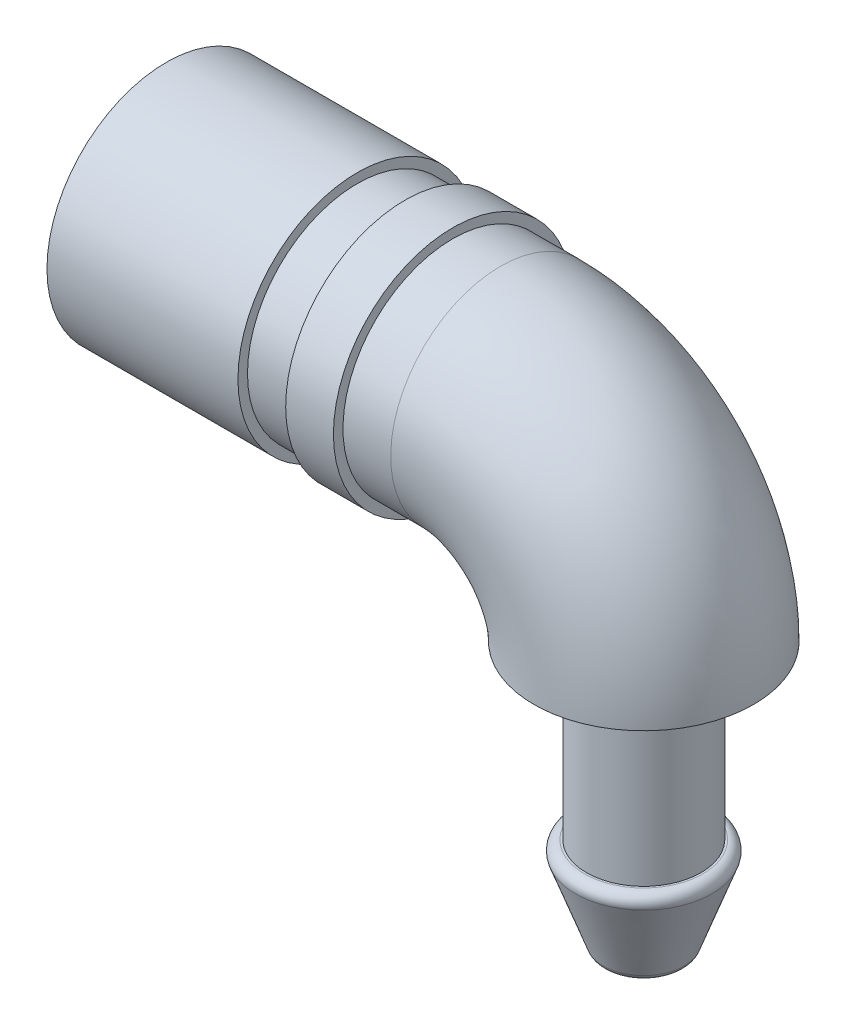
ISO-10303-21;
HEADER;
FILE_DESCRIPTION(('STEP AP214'),'2;1');
FILE_NAME('part.step','',(''),(''),'','','');
FILE_SCHEMA(('AUTOMOTIVE_DESIGN { 1 0 10303 214 1 1 1 1 }'));
ENDSEC;
DATA;
#1=APPLICATION_CONTEXT('core data for automotive mechanical design processes');
#2=APPLICATION_PROTOCOL_DEFINITION('international standard','automotive_design',2000,#1);
#3=PRODUCT_CONTEXT('',#1,'mechanical');
#4=PRODUCT('Part','Part','',(#3));
#5=PRODUCT_RELATED_PRODUCT_CATEGORY('part','',(#4));
#6=PRODUCT_DEFINITION_FORMATION('','',#4);
#7=PRODUCT_DEFINITION_CONTEXT('part definition',#1,'design');
#8=PRODUCT_DEFINITION('design','',#6,#7);
#9=PRODUCT_DEFINITION_SHAPE('','',#8);
#10=(LENGTH_UNIT() NAMED_UNIT(*) SI_UNIT(.MILLI.,.METRE.));
#11=(NAMED_UNIT(*) PLANE_ANGLE_UNIT() SI_UNIT($,.RADIAN.));
#12=(NAMED_UNIT(*) SI_UNIT($,.STERADIAN.) SOLID_ANGLE_UNIT());
#13=UNCERTAINTY_MEASURE_WITH_UNIT(LENGTH_MEASURE(1.E-05),#10,'distance_accuracy_value','');
#14=(GEOMETRIC_REPRESENTATION_CONTEXT(3) GLOBAL_UNCERTAINTY_ASSIGNED_CONTEXT((#13)) GLOBAL_UNIT_ASSIGNED_CONTEXT((#10,
#11,#12)) REPRESENTATION_CONTEXT('',''));
#15=CARTESIAN_POINT('',(0.,0.,0.));
#16=DIRECTION('',(0.,0.,1.));
#17=DIRECTION('',(1.,0.,0.));
#18=AXIS2_PLACEMENT_3D('',#15,#16,#17);
#19=CARTESIAN_POINT('',(0.,0.,0.));
#20=DIRECTION('',(1.,0.,0.));
#21=DIRECTION('',(0.,0.,-1.));
#22=AXIS2_PLACEMENT_3D('',#19,#20,#21);
#23=PLANE('',#22);
#24=CARTESIAN_POINT('',(0.,0.,0.));
#25=DIRECTION('',(-1.,0.,0.));
#26=DIRECTION('',(0.,0.,1.));
#27=AXIS2_PLACEMENT_3D('',#24,#25,#26);
#28=CIRCLE('',#27,12.5);
#29=CARTESIAN_POINT('',(0.,0.,12.5));
#30=VERTEX_POINT('',#29);
#31=EDGE_CURVE('E69',#30,#30,#28,.T.);
#32=ORIENTED_EDGE('',*,*,#31,.T.);
#33=EDGE_LOOP('',(#32));
#34=FACE_BOUND('',#33,.T.);
#35=ADVANCED_FACE('F33',(#34),#23,.F.);
#36=CARTESIAN_POINT('',(0.,0.,0.));
#37=DIRECTION('',(-1.,0.,0.));
#38=DIRECTION('',(0.,0.,1.));
#39=AXIS2_PLACEMENT_3D('',#36,#37,#38);
#40=CYLINDRICAL_SURFACE('',#39,12.5);
#41=ORIENTED_EDGE('',*,*,#31,.F.);
#42=EDGE_LOOP('',(#41));
#43=FACE_BOUND('',#42,.T.);
#44=CARTESIAN_POINT('',(20.,0.,0.));
#45=DIRECTION('',(-1.,0.,0.));
#46=DIRECTION('',(0.,0.,1.));
#47=AXIS2_PLACEMENT_3D('',#44,#45,#46);
#48=CIRCLE('',#47,12.5);
#49=CARTESIAN_POINT('',(20.,0.,12.5));
#50=VERTEX_POINT('',#49);
#51=EDGE_CURVE('E66',#50,#50,#48,.T.);
#52=ORIENTED_EDGE('',*,*,#51,.T.);
#53=EDGE_LOOP('',(#52));
#54=FACE_BOUND('',#53,.T.);
#55=ADVANCED_FACE('F144',(#43,#54),#40,.T.);
#56=CARTESIAN_POINT('',(20.,12.5,0.));
#57=DIRECTION('',(-1.,0.,0.));
#58=DIRECTION('',(0.,0.,1.));
#59=AXIS2_PLACEMENT_3D('',#56,#57,#58);
#60=PLANE('',#59);
#61=ORIENTED_EDGE('',*,*,#51,.F.);
#62=EDGE_LOOP('',(#61));
#63=FACE_BOUND('',#62,.T.);
#64=CARTESIAN_POINT('',(20.,0.,0.));
#65=DIRECTION('',(-1.,0.,0.));
#66=DIRECTION('',(0.,0.,1.));
#67=AXIS2_PLACEMENT_3D('',#64,#65,#66);
#68=CIRCLE('',#67,11.5);
#69=CARTESIAN_POINT('',(20.,0.,11.5));
#70=VERTEX_POINT('',#69);
#71=EDGE_CURVE('E63',#70,#70,#68,.T.);
#72=ORIENTED_EDGE('',*,*,#71,.T.);
#73=EDGE_LOOP('',(#72));
#74=FACE_BOUND('',#73,.T.);
#75=ADVANCED_FACE('F150',(#63,#74),#60,.F.);
#76=CARTESIAN_POINT('',(0.,0.,0.));
#77=DIRECTION('',(-1.,0.,0.));
#78=DIRECTION('',(0.,0.,1.));
#79=AXIS2_PLACEMENT_3D('',#76,#77,#78);
#80=CYLINDRICAL_SURFACE('',#79,11.5);
#81=ORIENTED_EDGE('',*,*,#71,.F.);
#82=EDGE_LOOP('',(#81));
#83=FACE_BOUND('',#82,.T.);
#84=CARTESIAN_POINT('',(25.,0.,0.));
#85=DIRECTION('',(-1.,0.,0.));
#86=DIRECTION('',(0.,0.,1.));
#87=AXIS2_PLACEMENT_3D('',#84,#85,#86);
#88=CIRCLE('',#87,11.5);
#89=CARTESIAN_POINT('',(25.,0.,11.5));
#90=VERTEX_POINT('',#89);
#91=EDGE_CURVE('E60',#90,#90,#88,.T.);
#92=ORIENTED_EDGE('',*,*,#91,.T.);
#93=EDGE_LOOP('',(#92));
#94=FACE_BOUND('',#93,.T.);
#95=ADVANCED_FACE('F139',(#83,#94),#80,.T.);
#96=CARTESIAN_POINT('',(25.,11.5,0.));
#97=DIRECTION('',(1.,0.,0.));
#98=DIRECTION('',(0.,0.,-1.));
#99=AXIS2_PLACEMENT_3D('',#96,#97,#98);
#100=PLANE('',#99);
#101=ORIENTED_EDGE('',*,*,#91,.F.);
#102=EDGE_LOOP('',(#101));
#103=FACE_BOUND('',#102,.T.);
#104=CARTESIAN_POINT('',(25.,0.,0.));
#105=DIRECTION('',(-1.,0.,0.));
#106=DIRECTION('',(0.,0.,1.));
#107=AXIS2_PLACEMENT_3D('',#104,#105,#106);
#108=CIRCLE('',#107,12.5);
#109=CARTESIAN_POINT('',(25.,0.,12.5));
#110=VERTEX_POINT('',#109);
#111=EDGE_CURVE('E51',#110,#110,#108,.T.);
#112=ORIENTED_EDGE('',*,*,#111,.T.);
#113=EDGE_LOOP('',(#112));
#114=FACE_BOUND('',#113,.T.);
#115=ADVANCED_FACE('F133',(#103,#114),#100,.F.);
#116=CARTESIAN_POINT('',(0.,0.,0.));
#117=DIRECTION('',(-1.,0.,0.));
#118=DIRECTION('',(0.,0.,1.));
#119=AXIS2_PLACEMENT_3D('',#116,#117,#118);
#120=CYLINDRICAL_SURFACE('',#119,12.5);
#121=ORIENTED_EDGE('',*,*,#111,.F.);
#122=EDGE_LOOP('',(#121));
#123=FACE_BOUND('',#122,.T.);
#124=CARTESIAN_POINT('',(30.,0.,0.));
#125=DIRECTION('',(-1.,0.,0.));
#126=DIRECTION('',(0.,0.,1.));
#127=AXIS2_PLACEMENT_3D('',#124,#125,#126);
#128=CIRCLE('',#127,12.5);
#129=CARTESIAN_POINT('',(30.,0.,12.5));
#130=VERTEX_POINT('',#129);
#131=EDGE_CURVE('E47',#130,#130,#128,.T.);
#132=ORIENTED_EDGE('',*,*,#131,.T.);
#133=EDGE_LOOP('',(#132));
#134=FACE_BOUND('',#133,.T.);
#135=ADVANCED_FACE('F127',(#123,#134),#120,.T.);
#136=CARTESIAN_POINT('',(30.,12.5,0.));
#137=DIRECTION('',(-1.,0.,0.));
#138=DIRECTION('',(0.,0.,1.));
#139=AXIS2_PLACEMENT_3D('',#136,#137,#138);
#140=PLANE('',#139);
#141=CARTESIAN_POINT('',(30.,0.,0.));
#142=DIRECTION('',(1.,0.,0.));
#143=DIRECTION('',(0.,0.,-1.));
#144=AXIS2_PLACEMENT_3D('',#141,#142,#143);
#145=CIRCLE('',#144,11.5);
#146=CARTESIAN_POINT('',(30.,0.,-11.5));
#147=VERTEX_POINT('',#146);
#148=EDGE_CURVE('E72',#147,#147,#145,.T.);
#149=ORIENTED_EDGE('',*,*,#148,.F.);
#150=EDGE_LOOP('',(#149));
#151=FACE_BOUND('',#150,.T.);
#152=ORIENTED_EDGE('',*,*,#131,.F.);
#153=EDGE_LOOP('',(#152));
#154=FACE_BOUND('',#153,.T.);
#155=ADVANCED_FACE('F124',(#151,#154),#140,.F.);
#156=CARTESIAN_POINT('',(50.,-15.0029464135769,0.));
#157=DIRECTION('',(0.,-1.,0.));
#158=DIRECTION('',(0.,0.,-1.));
#159=AXIS2_PLACEMENT_3D('',#156,#157,#158);
#160=PLANE('',#159);
#161=CARTESIAN_POINT('',(50.,-15.0029464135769,0.));
#162=DIRECTION('',(0.,1.,0.));
#163=DIRECTION('',(0.,0.,1.));
#164=AXIS2_PLACEMENT_3D('',#161,#162,#163);
#165=CIRCLE('',#164,6.);
#166=CARTESIAN_POINT('',(50.,-15.0029464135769,6.));
#167=VERTEX_POINT('',#166);
#168=EDGE_CURVE('E107',#167,#167,#165,.T.);
#169=ORIENTED_EDGE('',*,*,#168,.T.);
#170=EDGE_LOOP('',(#169));
#171=FACE_BOUND('',#170,.T.);
#172=CARTESIAN_POINT('',(50.,-15.0029464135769,0.));
#173=DIRECTION('',(0.,-1.,0.));
#174=DIRECTION('',(0.,0.,-1.));
#175=AXIS2_PLACEMENT_3D('',#172,#173,#174);
#176=CIRCLE('',#175,11.5);
#177=CARTESIAN_POINT('',(50.,-15.0029464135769,-11.5));
#178=VERTEX_POINT('',#177);
#179=EDGE_CURVE('E44',#178,#178,#176,.T.);
#180=ORIENTED_EDGE('',*,*,#179,.T.);
#181=EDGE_LOOP('',(#180));
#182=FACE_BOUND('',#181,.T.);
#183=ADVANCED_FACE('F45',(#171,#182),#160,.T.);
#184=CARTESIAN_POINT('',(30.,0.,0.));
#185=DIRECTION('',(1.,0.,0.));
#186=DIRECTION('',(0.,1.,0.));
#187=AXIS2_PLACEMENT_3D('',#184,#185,#186);
#188=CYLINDRICAL_SURFACE('',#187,11.5);
#189=CARTESIAN_POINT('',(35.,0.,0.));
#190=DIRECTION('',(1.,0.,0.));
#191=DIRECTION('',(0.,0.,-1.));
#192=AXIS2_PLACEMENT_3D('',#189,#190,#191);
#193=CIRCLE('',#192,11.5);
#194=CARTESIAN_POINT('',(35.,11.5,0.));
#195=VERTEX_POINT('',#194);
#196=EDGE_CURVE('E54',#195,#195,#193,.T.);
#197=ORIENTED_EDGE('',*,*,#196,.F.);
#198=EDGE_LOOP('',(#197));
#199=FACE_BOUND('',#198,.T.);
#200=ORIENTED_EDGE('',*,*,#148,.T.);
#201=EDGE_LOOP('',(#200));
#202=FACE_BOUND('',#201,.T.);
#203=ADVANCED_FACE('F118',(#199,#202),#188,.T.);
#204=CARTESIAN_POINT('',(35.,-15.,0.));
#205=DIRECTION('',(0.,0.,-1.));
#206=DIRECTION('',(-1.,0.,0.));
#207=AXIS2_PLACEMENT_3D('',#204,#205,#206);
#208=TOROIDAL_SURFACE('',#207,15.,11.5);
#209=CARTESIAN_POINT('',(50.,-15.,0.));
#210=DIRECTION('',(0.,-1.,0.));
#211=DIRECTION('',(0.,0.,-1.));
#212=AXIS2_PLACEMENT_3D('',#209,#210,#211);
#213=CIRCLE('',#212,11.5);
#214=CARTESIAN_POINT('',(61.5,-15.,0.));
#215=VERTEX_POINT('',#214);
#216=EDGE_CURVE('E48',#215,#215,#213,.T.);
#217=CARTESIAN_POINT('',(35.,-15.,0.));
#218=DIRECTION('',(0.,0.,-1.));
#219=DIRECTION('',(-1.,0.,0.));
#220=AXIS2_PLACEMENT_3D('',#217,#218,#219);
#221=CIRCLE('',#220,26.5);
#222=EDGE_CURVE('',#195,#215,#221,.T.);
#223=ORIENTED_EDGE('',*,*,#196,.T.);
#224=ORIENTED_EDGE('',*,*,#216,.F.);
#225=ORIENTED_EDGE('',*,*,#222,.T.);
#226=ORIENTED_EDGE('',*,*,#222,.F.);
#227=EDGE_LOOP('',(#223,#225,#224,#226));
#228=FACE_BOUND('',#227,.T.);
#229=ADVANCED_FACE('F116',(#228),#208,.T.);
#230=CARTESIAN_POINT('',(50.,-15.,0.));
#231=DIRECTION('',(0.,-1.,0.));
#232=DIRECTION('',(0.,0.,-1.));
#233=AXIS2_PLACEMENT_3D('',#230,#231,#232);
#234=CYLINDRICAL_SURFACE('',#233,11.5);
#235=ORIENTED_EDGE('',*,*,#179,.F.);
#236=EDGE_LOOP('',(#235));
#237=FACE_BOUND('',#236,.T.);
#238=ORIENTED_EDGE('',*,*,#216,.T.);
#239=EDGE_LOOP('',(#238));
#240=FACE_BOUND('',#239,.T.);
#241=ADVANCED_FACE('F129',(#237,#240),#234,.T.);
#242=CARTESIAN_POINT('',(50.,-15.0029464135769,0.));
#243=DIRECTION('',(0.,1.,0.));
#244=DIRECTION('',(0.,0.,1.));
#245=AXIS2_PLACEMENT_3D('',#242,#243,#244);
#246=CYLINDRICAL_SURFACE('',#245,6.);
#247=ORIENTED_EDGE('',*,*,#168,.F.);
#248=EDGE_LOOP('',(#247));
#249=FACE_BOUND('',#248,.T.);
#250=CARTESIAN_POINT('',(50.,-33.0029464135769,0.));
#251=DIRECTION('',(0.,1.,0.));
#252=DIRECTION('',(0.,0.,1.));
#253=AXIS2_PLACEMENT_3D('',#250,#251,#252);
#254=CIRCLE('',#253,6.);
#255=CARTESIAN_POINT('',(50.,-33.0029464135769,6.));
#256=VERTEX_POINT('',#255);
#257=EDGE_CURVE('E105',#256,#256,#254,.T.);
#258=ORIENTED_EDGE('',*,*,#257,.T.);
#259=EDGE_LOOP('',(#258));
#260=FACE_BOUND('',#259,.T.);
#261=ADVANCED_FACE('F101',(#249,#260),#246,.T.);
#262=CARTESIAN_POINT('',(56.,-33.0029464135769,0.));
#263=DIRECTION('',(0.,-1.,0.));
#264=DIRECTION('',(0.,0.,-1.));
#265=AXIS2_PLACEMENT_3D('',#262,#263,#264);
#266=PLANE('',#265);
#267=CARTESIAN_POINT('',(50.,-33.0029464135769,0.));
#268=DIRECTION('',(0.,-1.,0.));
#269=DIRECTION('',(0.,0.,-1.));
#270=AXIS2_PLACEMENT_3D('',#267,#268,#269);
#271=CIRCLE('',#270,6.21155433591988);
#272=CARTESIAN_POINT('',(50.,-33.0029464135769,-6.21155433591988));
#273=VERTEX_POINT('',#272);
#274=EDGE_CURVE('E11',#273,#273,#271,.F.);
#275=ORIENTED_EDGE('',*,*,#274,.T.);
#276=EDGE_LOOP('',(#275));
#277=FACE_BOUND('',#276,.T.);
#278=ORIENTED_EDGE('',*,*,#257,.F.);
#279=EDGE_LOOP('',(#278));
#280=FACE_BOUND('',#279,.T.);
#281=ADVANCED_FACE('F91',(#277,#280),#266,.F.);
#282=CARTESIAN_POINT('',(50.,-43.0029464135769,0.));
#283=DIRECTION('',(0.,1.,0.));
#284=DIRECTION('',(0.,0.,1.));
#285=AXIS2_PLACEMENT_3D('',#282,#283,#284);
#286=CONICAL_SURFACE('',#285,4.,0.349065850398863);
#287=CARTESIAN_POINT('',(50.,-42.3449665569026,0.));
#288=DIRECTION('',(0.,-1.,0.));
#289=DIRECTION('',(0.,0.,-1.));
#290=AXIS2_PLACEMENT_3D('',#287,#288,#289);
#291=CIRCLE('',#290,4.2394850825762);
#292=CARTESIAN_POINT('',(50.,-42.3449665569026,-4.2394850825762));
#293=VERTEX_POINT('',#292);
#294=EDGE_CURVE('E76',#293,#293,#291,.F.);
#295=ORIENTED_EDGE('',*,*,#294,.T.);
#296=EDGE_LOOP('',(#295));
#297=FACE_BOUND('',#296,.T.);
#298=CARTESIAN_POINT('',(50.,-34.3449665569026,0.));
#299=DIRECTION('',(0.,-1.,0.));
#300=DIRECTION('',(0.,0.,-1.));
#301=AXIS2_PLACEMENT_3D('',#298,#299,#300);
#302=CIRCLE('',#301,7.1512469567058);
#303=CARTESIAN_POINT('',(50.,-34.3449665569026,-7.1512469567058));
#304=VERTEX_POINT('',#303);
#305=EDGE_CURVE('E73',#304,#304,#302,.T.);
#306=ORIENTED_EDGE('',*,*,#305,.T.);
#307=EDGE_LOOP('',(#306));
#308=FACE_BOUND('',#307,.T.);
#309=ADVANCED_FACE('F88',(#297,#308),#286,.T.);
#310=CARTESIAN_POINT('',(54.,-43.0029464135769,0.));
#311=DIRECTION('',(0.,1.,0.));
#312=DIRECTION('',(0.,0.,1.));
#313=AXIS2_PLACEMENT_3D('',#310,#311,#312);
#314=PLANE('',#313);
#315=CARTESIAN_POINT('',(50.,-43.0029464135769,0.));
#316=DIRECTION('',(0.,1.,0.));
#317=DIRECTION('',(0.,0.,1.));
#318=AXIS2_PLACEMENT_3D('',#315,#316,#317);
#319=CIRCLE('',#318,3.29979246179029);
#320=CARTESIAN_POINT('',(50.,-43.0029464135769,3.29979246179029));
#321=VERTEX_POINT('',#320);
#322=EDGE_CURVE('E40',#321,#321,#319,.F.);
#323=ORIENTED_EDGE('',*,*,#322,.T.);
#324=EDGE_LOOP('',(#323));
#325=FACE_BOUND('',#324,.T.);
#326=ADVANCED_FACE('F81',(#325),#314,.F.);
#327=CARTESIAN_POINT('',(50.,-42.0029464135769,0.));
#328=DIRECTION('',(0.,1.,0.));
#329=DIRECTION('',(0.,0.,1.));
#330=AXIS2_PLACEMENT_3D('',#327,#328,#329);
#331=TOROIDAL_SURFACE('',#330,3.29979246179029,1.);
#332=ORIENTED_EDGE('',*,*,#322,.F.);
#333=EDGE_LOOP('',(#332));
#334=FACE_BOUND('',#333,.T.);
#335=ORIENTED_EDGE('',*,*,#294,.F.);
#336=EDGE_LOOP('',(#335));
#337=FACE_BOUND('',#336,.T.);
#338=ADVANCED_FACE('F83',(#334,#337),#331,.T.);
#339=CARTESIAN_POINT('',(50.,-34.0029464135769,0.));
#340=DIRECTION('',(0.,-1.,0.));
#341=DIRECTION('',(0.,0.,-1.));
#342=AXIS2_PLACEMENT_3D('',#339,#340,#341);
#343=TOROIDAL_SURFACE('',#342,6.21155433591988,1.);
#344=ORIENTED_EDGE('',*,*,#305,.F.);
#345=EDGE_LOOP('',(#344));
#346=FACE_BOUND('',#345,.T.);
#347=ORIENTED_EDGE('',*,*,#274,.F.);
#348=EDGE_LOOP('',(#347));
#349=FACE_BOUND('',#348,.T.);
#350=ADVANCED_FACE('F35',(#346,#349),#343,.T.);
#351=CLOSED_SHELL('',(#35,#55,#75,#95,#115,#135,#155,#183,#203,#229,#241,#261,#281,#309,#326,
#338,#350));
#352=MANIFOLD_SOLID_BREP('B2',#351);
#353=ADVANCED_BREP_SHAPE_REPRESENTATION('',(#18,#352),#14);
#354=SHAPE_DEFINITION_REPRESENTATION(#9,#353);
ENDSEC;
END-ISO-10303-21;
